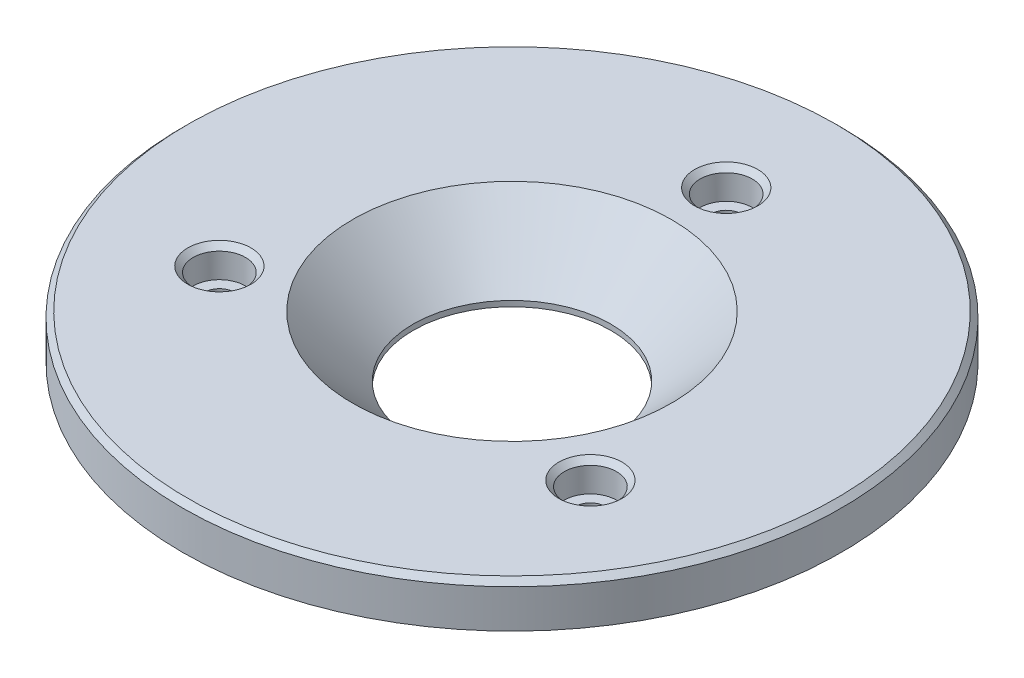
ISO-10303-21;
HEADER;
FILE_DESCRIPTION(('STEP AP214'),'2;1');
FILE_NAME('part.step','',(''),(''),'','','');
FILE_SCHEMA(('AUTOMOTIVE_DESIGN { 1 0 10303 214 1 1 1 1 }'));
ENDSEC;
DATA;
#1=APPLICATION_CONTEXT('core data for automotive mechanical design processes');
#2=APPLICATION_PROTOCOL_DEFINITION('international standard','automotive_design',2000,#1);
#3=PRODUCT_CONTEXT('',#1,'mechanical');
#4=PRODUCT('Part','Part','',(#3));
#5=PRODUCT_RELATED_PRODUCT_CATEGORY('part','',(#4));
#6=PRODUCT_DEFINITION_FORMATION('','',#4);
#7=PRODUCT_DEFINITION_CONTEXT('part definition',#1,'design');
#8=PRODUCT_DEFINITION('design','',#6,#7);
#9=PRODUCT_DEFINITION_SHAPE('','',#8);
#10=(LENGTH_UNIT() NAMED_UNIT(*) SI_UNIT(.MILLI.,.METRE.));
#11=(NAMED_UNIT(*) PLANE_ANGLE_UNIT() SI_UNIT($,.RADIAN.));
#12=(NAMED_UNIT(*) SI_UNIT($,.STERADIAN.) SOLID_ANGLE_UNIT());
#13=UNCERTAINTY_MEASURE_WITH_UNIT(LENGTH_MEASURE(1.E-05),#10,'distance_accuracy_value','');
#14=(GEOMETRIC_REPRESENTATION_CONTEXT(3) GLOBAL_UNCERTAINTY_ASSIGNED_CONTEXT((#13)) GLOBAL_UNIT_ASSIGNED_CONTEXT((#10,
#11,#12)) REPRESENTATION_CONTEXT('',''));
#15=CARTESIAN_POINT('',(0.,0.,0.));
#16=DIRECTION('',(0.,0.,1.));
#17=DIRECTION('',(1.,0.,0.));
#18=AXIS2_PLACEMENT_3D('',#15,#16,#17);
#19=CARTESIAN_POINT('',(-29.,12.,0.));
#20=DIRECTION('',(0.,-1.,0.));
#21=DIRECTION('',(0.,0.,-1.));
#22=AXIS2_PLACEMENT_3D('',#19,#20,#21);
#23=PLANE('',#22);
#24=CARTESIAN_POINT('',(33.7749907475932,12.,19.5));
#25=DIRECTION('',(0.,-1.,0.));
#26=DIRECTION('',(0.,0.,-1.));
#27=AXIS2_PLACEMENT_3D('',#24,#25,#26);
#28=CIRCLE('',#27,5.75);
#29=CARTESIAN_POINT('',(33.7749907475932,12.,13.75));
#30=VERTEX_POINT('',#29);
#31=EDGE_CURVE('E25',#30,#30,#28,.T.);
#32=ORIENTED_EDGE('',*,*,#31,.T.);
#33=EDGE_LOOP('',(#32));
#34=FACE_BOUND('',#33,.T.);
#35=CARTESIAN_POINT('',(0.,12.,-39.));
#36=DIRECTION('',(0.,-1.,0.));
#37=DIRECTION('',(0.,0.,-1.));
#38=AXIS2_PLACEMENT_3D('',#35,#36,#37);
#39=CIRCLE('',#38,5.75);
#40=CARTESIAN_POINT('',(0.,12.,-44.75));
#41=VERTEX_POINT('',#40);
#42=EDGE_CURVE('E29',#41,#41,#39,.T.);
#43=ORIENTED_EDGE('',*,*,#42,.T.);
#44=EDGE_LOOP('',(#43));
#45=FACE_BOUND('',#44,.T.);
#46=CARTESIAN_POINT('',(-33.7749907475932,12.,19.5));
#47=DIRECTION('',(0.,-1.,0.));
#48=DIRECTION('',(0.,0.,-1.));
#49=AXIS2_PLACEMENT_3D('',#46,#47,#48);
#50=CIRCLE('',#49,5.75);
#51=CARTESIAN_POINT('',(-33.7749907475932,12.,13.75));
#52=VERTEX_POINT('',#51);
#53=EDGE_CURVE('E34',#52,#52,#50,.T.);
#54=ORIENTED_EDGE('',*,*,#53,.T.);
#55=EDGE_LOOP('',(#54));
#56=FACE_BOUND('',#55,.T.);
#57=CARTESIAN_POINT('',(0.,12.,0.));
#58=DIRECTION('',(0.,-1.,0.));
#59=DIRECTION('',(0.,0.,-1.));
#60=AXIS2_PLACEMENT_3D('',#57,#58,#59);
#61=CIRCLE('',#60,59.);
#62=CARTESIAN_POINT('',(0.,12.,-59.));
#63=VERTEX_POINT('',#62);
#64=EDGE_CURVE('E58',#63,#63,#61,.F.);
#65=ORIENTED_EDGE('',*,*,#64,.T.);
#66=EDGE_LOOP('',(#65));
#67=FACE_BOUND('',#66,.T.);
#68=CARTESIAN_POINT('',(0.,12.,0.));
#69=DIRECTION('',(0.,-1.,0.));
#70=DIRECTION('',(0.,0.,-1.));
#71=AXIS2_PLACEMENT_3D('',#68,#69,#70);
#72=CIRCLE('',#71,29.);
#73=CARTESIAN_POINT('',(0.,12.,-29.));
#74=VERTEX_POINT('',#73);
#75=EDGE_CURVE('E70',#74,#74,#72,.T.);
#76=ORIENTED_EDGE('',*,*,#75,.T.);
#77=EDGE_LOOP('',(#76));
#78=FACE_BOUND('',#77,.T.);
#79=ADVANCED_FACE('F14',(#34,#45,#56,#67,#78),#23,.F.);
#80=CARTESIAN_POINT('',(0.,1.,0.));
#81=DIRECTION('',(0.,1.,0.));
#82=DIRECTION('',(0.,0.,1.));
#83=AXIS2_PLACEMENT_3D('',#80,#81,#82);
#84=CONICAL_SURFACE('',#83,18.,0.78539816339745);
#85=ORIENTED_EDGE('',*,*,#75,.F.);
#86=EDGE_LOOP('',(#85));
#87=FACE_BOUND('',#86,.T.);
#88=CARTESIAN_POINT('',(0.,1.,0.));
#89=DIRECTION('',(0.,-1.,0.));
#90=DIRECTION('',(0.,0.,-1.));
#91=AXIS2_PLACEMENT_3D('',#88,#89,#90);
#92=CIRCLE('',#91,18.);
#93=CARTESIAN_POINT('',(0.,1.,-18.));
#94=VERTEX_POINT('',#93);
#95=EDGE_CURVE('E83',#94,#94,#92,.T.);
#96=ORIENTED_EDGE('',*,*,#95,.T.);
#97=EDGE_LOOP('',(#96));
#98=FACE_BOUND('',#97,.T.);
#99=ADVANCED_FACE('F123',(#87,#98),#84,.F.);
#100=CARTESIAN_POINT('',(0.,0.,0.));
#101=DIRECTION('',(0.,-1.,0.));
#102=DIRECTION('',(0.,0.,-1.));
#103=AXIS2_PLACEMENT_3D('',#100,#101,#102);
#104=CYLINDRICAL_SURFACE('',#103,18.);
#105=ORIENTED_EDGE('',*,*,#95,.F.);
#106=EDGE_LOOP('',(#105));
#107=FACE_BOUND('',#106,.T.);
#108=CARTESIAN_POINT('',(0.,0.,0.));
#109=DIRECTION('',(0.,-1.,0.));
#110=DIRECTION('',(0.,0.,-1.));
#111=AXIS2_PLACEMENT_3D('',#108,#109,#110);
#112=CIRCLE('',#111,18.);
#113=CARTESIAN_POINT('',(0.,0.,-18.));
#114=VERTEX_POINT('',#113);
#115=EDGE_CURVE('E86',#114,#114,#112,.T.);
#116=ORIENTED_EDGE('',*,*,#115,.T.);
#117=EDGE_LOOP('',(#116));
#118=FACE_BOUND('',#117,.T.);
#119=ADVANCED_FACE('F130',(#107,#118),#104,.F.);
#120=CARTESIAN_POINT('',(-18.,0.,0.));
#121=DIRECTION('',(0.,1.,0.));
#122=DIRECTION('',(0.,0.,1.));
#123=AXIS2_PLACEMENT_3D('',#120,#121,#122);
#124=PLANE('',#123);
#125=CARTESIAN_POINT('',(-33.7749907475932,0.,19.5));
#126=DIRECTION('',(0.,1.,0.));
#127=DIRECTION('',(0.,0.,1.));
#128=AXIS2_PLACEMENT_3D('',#125,#126,#127);
#129=CIRCLE('',#128,3.75);
#130=CARTESIAN_POINT('',(-33.7749907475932,0.,23.25));
#131=VERTEX_POINT('',#130);
#132=EDGE_CURVE('E49',#131,#131,#129,.T.);
#133=ORIENTED_EDGE('',*,*,#132,.T.);
#134=EDGE_LOOP('',(#133));
#135=FACE_BOUND('',#134,.T.);
#136=CARTESIAN_POINT('',(33.7749907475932,0.,19.5));
#137=DIRECTION('',(0.,1.,0.));
#138=DIRECTION('',(0.,0.,1.));
#139=AXIS2_PLACEMENT_3D('',#136,#137,#138);
#140=CIRCLE('',#139,3.75);
#141=CARTESIAN_POINT('',(33.7749907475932,0.,23.25));
#142=VERTEX_POINT('',#141);
#143=EDGE_CURVE('E52',#142,#142,#140,.T.);
#144=ORIENTED_EDGE('',*,*,#143,.T.);
#145=EDGE_LOOP('',(#144));
#146=FACE_BOUND('',#145,.T.);
#147=CARTESIAN_POINT('',(0.,0.,-39.));
#148=DIRECTION('',(0.,1.,0.));
#149=DIRECTION('',(0.,0.,1.));
#150=AXIS2_PLACEMENT_3D('',#147,#148,#149);
#151=CIRCLE('',#150,3.75);
#152=CARTESIAN_POINT('',(0.,0.,-35.25));
#153=VERTEX_POINT('',#152);
#154=EDGE_CURVE('E55',#153,#153,#151,.T.);
#155=ORIENTED_EDGE('',*,*,#154,.T.);
#156=EDGE_LOOP('',(#155));
#157=FACE_BOUND('',#156,.T.);
#158=CARTESIAN_POINT('',(0.,0.,0.));
#159=DIRECTION('',(0.,1.,0.));
#160=DIRECTION('',(0.,0.,1.));
#161=AXIS2_PLACEMENT_3D('',#158,#159,#160);
#162=CIRCLE('',#161,44.);
#163=CARTESIAN_POINT('',(0.,0.,44.));
#164=VERTEX_POINT('',#163);
#165=EDGE_CURVE('E67',#164,#164,#162,.F.);
#166=ORIENTED_EDGE('',*,*,#165,.T.);
#167=EDGE_LOOP('',(#166));
#168=FACE_BOUND('',#167,.T.);
#169=ORIENTED_EDGE('',*,*,#115,.F.);
#170=EDGE_LOOP('',(#169));
#171=FACE_BOUND('',#170,.T.);
#172=ADVANCED_FACE('F181',(#135,#146,#157,#168,#171),#124,.F.);
#173=CARTESIAN_POINT('',(0.,0.,0.));
#174=DIRECTION('',(0.,-1.,0.));
#175=DIRECTION('',(0.,0.,-1.));
#176=AXIS2_PLACEMENT_3D('',#173,#174,#175);
#177=CYLINDRICAL_SURFACE('',#176,45.);
#178=CARTESIAN_POINT('',(0.,0.999999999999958,0.));
#179=DIRECTION('',(0.,1.,0.));
#180=DIRECTION('',(0.,0.,1.));
#181=AXIS2_PLACEMENT_3D('',#178,#179,#180);
#182=CIRCLE('',#181,45.);
#183=CARTESIAN_POINT('',(0.,0.999999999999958,45.));
#184=VERTEX_POINT('',#183);
#185=EDGE_CURVE('E64',#184,#184,#182,.T.);
#186=ORIENTED_EDGE('',*,*,#185,.T.);
#187=EDGE_LOOP('',(#186));
#188=FACE_BOUND('',#187,.T.);
#189=CARTESIAN_POINT('',(0.,4.,0.));
#190=DIRECTION('',(0.,-1.,0.));
#191=DIRECTION('',(0.,0.,-1.));
#192=AXIS2_PLACEMENT_3D('',#189,#190,#191);
#193=CIRCLE('',#192,45.);
#194=CARTESIAN_POINT('',(0.,4.,-45.));
#195=VERTEX_POINT('',#194);
#196=EDGE_CURVE('E89',#195,#195,#193,.T.);
#197=ORIENTED_EDGE('',*,*,#196,.T.);
#198=EDGE_LOOP('',(#197));
#199=FACE_BOUND('',#198,.T.);
#200=ADVANCED_FACE('F185',(#188,#199),#177,.T.);
#201=CARTESIAN_POINT('',(-45.,4.,0.));
#202=DIRECTION('',(0.,1.,0.));
#203=DIRECTION('',(0.,0.,1.));
#204=AXIS2_PLACEMENT_3D('',#201,#202,#203);
#205=PLANE('',#204);
#206=ORIENTED_EDGE('',*,*,#196,.F.);
#207=EDGE_LOOP('',(#206));
#208=FACE_BOUND('',#207,.T.);
#209=CARTESIAN_POINT('',(0.,4.,0.));
#210=DIRECTION('',(0.,-1.,0.));
#211=DIRECTION('',(0.,0.,-1.));
#212=AXIS2_PLACEMENT_3D('',#209,#210,#211);
#213=CIRCLE('',#212,60.);
#214=CARTESIAN_POINT('',(0.,4.,-60.));
#215=VERTEX_POINT('',#214);
#216=EDGE_CURVE('E92',#215,#215,#213,.T.);
#217=ORIENTED_EDGE('',*,*,#216,.T.);
#218=EDGE_LOOP('',(#217));
#219=FACE_BOUND('',#218,.T.);
#220=ADVANCED_FACE('F192',(#208,#219),#205,.F.);
#221=CARTESIAN_POINT('',(0.,0.,0.));
#222=DIRECTION('',(0.,-1.,0.));
#223=DIRECTION('',(0.,0.,-1.));
#224=AXIS2_PLACEMENT_3D('',#221,#222,#223);
#225=CYLINDRICAL_SURFACE('',#224,60.);
#226=CARTESIAN_POINT('',(0.,11.,0.));
#227=DIRECTION('',(0.,-1.,0.));
#228=DIRECTION('',(0.,0.,-1.));
#229=AXIS2_PLACEMENT_3D('',#226,#227,#228);
#230=CIRCLE('',#229,60.);
#231=CARTESIAN_POINT('',(0.,11.,-60.));
#232=VERTEX_POINT('',#231);
#233=EDGE_CURVE('E61',#232,#232,#230,.T.);
#234=ORIENTED_EDGE('',*,*,#233,.T.);
#235=EDGE_LOOP('',(#234));
#236=FACE_BOUND('',#235,.T.);
#237=ORIENTED_EDGE('',*,*,#216,.F.);
#238=EDGE_LOOP('',(#237));
#239=FACE_BOUND('',#238,.T.);
#240=ADVANCED_FACE('F199',(#236,#239),#225,.T.);
#241=CARTESIAN_POINT('',(33.7749907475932,6.5,19.5));
#242=DIRECTION('',(0.,1.,0.));
#243=DIRECTION('',(0.,0.,1.));
#244=AXIS2_PLACEMENT_3D('',#241,#242,#243);
#245=CYLINDRICAL_SURFACE('',#244,4.75);
#246=CARTESIAN_POINT('',(33.7749907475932,11.,19.5));
#247=DIRECTION('',(0.,-1.,0.));
#248=DIRECTION('',(0.,0.,-1.));
#249=AXIS2_PLACEMENT_3D('',#246,#247,#248);
#250=CIRCLE('',#249,4.75);
#251=CARTESIAN_POINT('',(33.7749907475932,11.,14.75));
#252=VERTEX_POINT('',#251);
#253=EDGE_CURVE('E37',#252,#252,#250,.F.);
#254=ORIENTED_EDGE('',*,*,#253,.T.);
#255=EDGE_LOOP('',(#254));
#256=FACE_BOUND('',#255,.T.);
#257=CARTESIAN_POINT('',(33.7749907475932,6.5,19.5));
#258=DIRECTION('',(0.,1.,0.));
#259=DIRECTION('',(0.,0.,-1.));
#260=AXIS2_PLACEMENT_3D('',#257,#258,#259);
#261=CIRCLE('',#260,4.75);
#262=CARTESIAN_POINT('',(33.7749907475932,6.5,14.75));
#263=VERTEX_POINT('',#262);
#264=EDGE_CURVE('E74',#263,#263,#261,.T.);
#265=ORIENTED_EDGE('',*,*,#264,.F.);
#266=EDGE_LOOP('',(#265));
#267=FACE_BOUND('',#266,.T.);
#268=ADVANCED_FACE('F203',(#256,#267),#245,.F.);
#269=CARTESIAN_POINT('',(33.7749907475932,6.5,19.5));
#270=DIRECTION('',(0.,-1.,0.));
#271=DIRECTION('',(0.,0.,-1.));
#272=AXIS2_PLACEMENT_3D('',#269,#270,#271);
#273=PLANE('',#272);
#274=CARTESIAN_POINT('',(33.7749907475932,6.5,19.5));
#275=DIRECTION('',(0.,-1.,0.));
#276=DIRECTION('',(0.,0.,-1.));
#277=AXIS2_PLACEMENT_3D('',#274,#275,#276);
#278=CIRCLE('',#277,2.75);
#279=CARTESIAN_POINT('',(33.7749907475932,6.5,16.75));
#280=VERTEX_POINT('',#279);
#281=EDGE_CURVE('E71',#280,#280,#278,.T.);
#282=ORIENTED_EDGE('',*,*,#281,.T.);
#283=EDGE_LOOP('',(#282));
#284=FACE_BOUND('',#283,.T.);
#285=ORIENTED_EDGE('',*,*,#264,.T.);
#286=EDGE_LOOP('',(#285));
#287=FACE_BOUND('',#286,.T.);
#288=ADVANCED_FACE('F207',(#284,#287),#273,.F.);
#289=CARTESIAN_POINT('',(-33.7749907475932,6.5,19.5));
#290=DIRECTION('',(0.,1.,0.));
#291=DIRECTION('',(0.,0.,1.));
#292=AXIS2_PLACEMENT_3D('',#289,#290,#291);
#293=CYLINDRICAL_SURFACE('',#292,4.75);
#294=CARTESIAN_POINT('',(-33.7749907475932,11.,19.5));
#295=DIRECTION('',(0.,-1.,0.));
#296=DIRECTION('',(0.,0.,-1.));
#297=AXIS2_PLACEMENT_3D('',#294,#295,#296);
#298=CIRCLE('',#297,4.75);
#299=CARTESIAN_POINT('',(-33.7749907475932,11.,14.75));
#300=VERTEX_POINT('',#299);
#301=EDGE_CURVE('E9',#300,#300,#298,.F.);
#302=ORIENTED_EDGE('',*,*,#301,.T.);
#303=EDGE_LOOP('',(#302));
#304=FACE_BOUND('',#303,.T.);
#305=CARTESIAN_POINT('',(-33.7749907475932,6.5,19.5));
#306=DIRECTION('',(0.,1.,0.));
#307=DIRECTION('',(0.,0.,1.));
#308=AXIS2_PLACEMENT_3D('',#305,#306,#307);
#309=CIRCLE('',#308,4.75);
#310=CARTESIAN_POINT('',(-33.7749907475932,6.5,24.25));
#311=VERTEX_POINT('',#310);
#312=EDGE_CURVE('E98',#311,#311,#309,.T.);
#313=ORIENTED_EDGE('',*,*,#312,.F.);
#314=EDGE_LOOP('',(#313));
#315=FACE_BOUND('',#314,.T.);
#316=ADVANCED_FACE('F119',(#304,#315),#293,.F.);
#317=CARTESIAN_POINT('',(-33.7749907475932,6.5,19.5));
#318=DIRECTION('',(0.,1.,0.));
#319=DIRECTION('',(0.,0.,1.));
#320=AXIS2_PLACEMENT_3D('',#317,#318,#319);
#321=PLANE('',#320);
#322=CARTESIAN_POINT('',(-33.7749907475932,6.5,19.5));
#323=DIRECTION('',(0.,1.,0.));
#324=DIRECTION('',(0.,0.,1.));
#325=AXIS2_PLACEMENT_3D('',#322,#323,#324);
#326=CIRCLE('',#325,2.75);
#327=CARTESIAN_POINT('',(-33.7749907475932,6.5,22.25));
#328=VERTEX_POINT('',#327);
#329=EDGE_CURVE('E75',#328,#328,#326,.T.);
#330=ORIENTED_EDGE('',*,*,#329,.F.);
#331=EDGE_LOOP('',(#330));
#332=FACE_BOUND('',#331,.T.);
#333=ORIENTED_EDGE('',*,*,#312,.T.);
#334=EDGE_LOOP('',(#333));
#335=FACE_BOUND('',#334,.T.);
#336=ADVANCED_FACE('F108',(#332,#335),#321,.T.);
#337=CARTESIAN_POINT('',(0.,6.5,-39.));
#338=DIRECTION('',(0.,1.,0.));
#339=DIRECTION('',(0.,0.,1.));
#340=AXIS2_PLACEMENT_3D('',#337,#338,#339);
#341=CYLINDRICAL_SURFACE('',#340,4.75);
#342=CARTESIAN_POINT('',(0.,11.,-39.));
#343=DIRECTION('',(0.,-1.,0.));
#344=DIRECTION('',(0.,0.,-1.));
#345=AXIS2_PLACEMENT_3D('',#342,#343,#344);
#346=CIRCLE('',#345,4.75);
#347=CARTESIAN_POINT('',(0.,11.,-43.75));
#348=VERTEX_POINT('',#347);
#349=EDGE_CURVE('E21',#348,#348,#346,.F.);
#350=ORIENTED_EDGE('',*,*,#349,.T.);
#351=EDGE_LOOP('',(#350));
#352=FACE_BOUND('',#351,.T.);
#353=CARTESIAN_POINT('',(0.,6.5,-39.));
#354=DIRECTION('',(0.,1.,0.));
#355=DIRECTION('',(0.,0.,1.));
#356=AXIS2_PLACEMENT_3D('',#353,#354,#355);
#357=CIRCLE('',#356,4.75);
#358=CARTESIAN_POINT('',(0.,6.5,-34.25));
#359=VERTEX_POINT('',#358);
#360=EDGE_CURVE('E95',#359,#359,#357,.T.);
#361=ORIENTED_EDGE('',*,*,#360,.F.);
#362=EDGE_LOOP('',(#361));
#363=FACE_BOUND('',#362,.T.);
#364=ADVANCED_FACE('F106',(#352,#363),#341,.F.);
#365=CARTESIAN_POINT('',(0.,6.5,-39.));
#366=DIRECTION('',(0.,1.,0.));
#367=DIRECTION('',(0.,0.,1.));
#368=AXIS2_PLACEMENT_3D('',#365,#366,#367);
#369=PLANE('',#368);
#370=CARTESIAN_POINT('',(0.,6.5,-39.));
#371=DIRECTION('',(0.,1.,0.));
#372=DIRECTION('',(0.,0.,1.));
#373=AXIS2_PLACEMENT_3D('',#370,#371,#372);
#374=CIRCLE('',#373,2.75);
#375=CARTESIAN_POINT('',(0.,6.5,-36.25));
#376=VERTEX_POINT('',#375);
#377=EDGE_CURVE('E78',#376,#376,#374,.T.);
#378=ORIENTED_EDGE('',*,*,#377,.F.);
#379=EDGE_LOOP('',(#378));
#380=FACE_BOUND('',#379,.T.);
#381=ORIENTED_EDGE('',*,*,#360,.T.);
#382=EDGE_LOOP('',(#381));
#383=FACE_BOUND('',#382,.T.);
#384=ADVANCED_FACE('F104',(#380,#383),#369,.T.);
#385=CARTESIAN_POINT('',(0.,0.,-39.));
#386=DIRECTION('',(0.,1.,0.));
#387=DIRECTION('',(0.,0.,1.));
#388=AXIS2_PLACEMENT_3D('',#385,#386,#387);
#389=CYLINDRICAL_SURFACE('',#388,2.75);
#390=CARTESIAN_POINT('',(0.,1.,-39.));
#391=DIRECTION('',(0.,1.,0.));
#392=DIRECTION('',(0.,0.,1.));
#393=AXIS2_PLACEMENT_3D('',#390,#391,#392);
#394=CIRCLE('',#393,2.75);
#395=CARTESIAN_POINT('',(0.,1.,-36.25));
#396=VERTEX_POINT('',#395);
#397=EDGE_CURVE('E40',#396,#396,#394,.F.);
#398=ORIENTED_EDGE('',*,*,#397,.T.);
#399=EDGE_LOOP('',(#398));
#400=FACE_BOUND('',#399,.T.);
#401=ORIENTED_EDGE('',*,*,#377,.T.);
#402=EDGE_LOOP('',(#401));
#403=FACE_BOUND('',#402,.T.);
#404=ADVANCED_FACE('F116',(#400,#403),#389,.F.);
#405=CARTESIAN_POINT('',(-33.7749907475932,0.,19.5));
#406=DIRECTION('',(0.,1.,0.));
#407=DIRECTION('',(0.,0.,1.));
#408=AXIS2_PLACEMENT_3D('',#405,#406,#407);
#409=CYLINDRICAL_SURFACE('',#408,2.75);
#410=CARTESIAN_POINT('',(-33.7749907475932,0.999999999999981,19.5));
#411=DIRECTION('',(0.,1.,0.));
#412=DIRECTION('',(0.,0.,1.));
#413=AXIS2_PLACEMENT_3D('',#410,#411,#412);
#414=CIRCLE('',#413,2.75);
#415=CARTESIAN_POINT('',(-33.7749907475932,0.999999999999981,22.25));
#416=VERTEX_POINT('',#415);
#417=EDGE_CURVE('E46',#416,#416,#414,.F.);
#418=ORIENTED_EDGE('',*,*,#417,.T.);
#419=EDGE_LOOP('',(#418));
#420=FACE_BOUND('',#419,.T.);
#421=ORIENTED_EDGE('',*,*,#329,.T.);
#422=EDGE_LOOP('',(#421));
#423=FACE_BOUND('',#422,.T.);
#424=ADVANCED_FACE('F338',(#420,#423),#409,.F.);
#425=CARTESIAN_POINT('',(33.7749907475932,0.,19.5));
#426=DIRECTION('',(0.,1.,0.));
#427=DIRECTION('',(0.,0.,1.));
#428=AXIS2_PLACEMENT_3D('',#425,#426,#427);
#429=CYLINDRICAL_SURFACE('',#428,2.75);
#430=CARTESIAN_POINT('',(33.7749907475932,0.999999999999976,19.5));
#431=DIRECTION('',(0.,1.,0.));
#432=DIRECTION('',(0.,0.,1.));
#433=AXIS2_PLACEMENT_3D('',#430,#431,#432);
#434=CIRCLE('',#433,2.75);
#435=CARTESIAN_POINT('',(33.7749907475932,0.999999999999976,22.25));
#436=VERTEX_POINT('',#435);
#437=EDGE_CURVE('E43',#436,#436,#434,.F.);
#438=ORIENTED_EDGE('',*,*,#437,.T.);
#439=EDGE_LOOP('',(#438));
#440=FACE_BOUND('',#439,.T.);
#441=ORIENTED_EDGE('',*,*,#281,.F.);
#442=EDGE_LOOP('',(#441));
#443=FACE_BOUND('',#442,.T.);
#444=ADVANCED_FACE('F140',(#440,#443),#429,.F.);
#445=CARTESIAN_POINT('',(0.,0.,0.));
#446=DIRECTION('',(0.,1.,0.));
#447=DIRECTION('',(0.,0.,1.));
#448=AXIS2_PLACEMENT_3D('',#445,#446,#447);
#449=CONICAL_SURFACE('',#448,44.,0.785398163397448);
#450=ORIENTED_EDGE('',*,*,#185,.F.);
#451=EDGE_LOOP('',(#450));
#452=FACE_BOUND('',#451,.T.);
#453=ORIENTED_EDGE('',*,*,#165,.F.);
#454=EDGE_LOOP('',(#453));
#455=FACE_BOUND('',#454,.T.);
#456=ADVANCED_FACE('F136',(#452,#455),#449,.T.);
#457=CARTESIAN_POINT('',(0.,11.,0.));
#458=DIRECTION('',(0.,-1.,0.));
#459=DIRECTION('',(0.,0.,-1.));
#460=AXIS2_PLACEMENT_3D('',#457,#458,#459);
#461=CONICAL_SURFACE('',#460,60.,0.785398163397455);
#462=ORIENTED_EDGE('',*,*,#64,.F.);
#463=EDGE_LOOP('',(#462));
#464=FACE_BOUND('',#463,.T.);
#465=ORIENTED_EDGE('',*,*,#233,.F.);
#466=EDGE_LOOP('',(#465));
#467=FACE_BOUND('',#466,.T.);
#468=ADVANCED_FACE('F139',(#464,#467),#461,.T.);
#469=CARTESIAN_POINT('',(-33.7749907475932,0.,19.5));
#470=DIRECTION('',(0.,-1.,0.));
#471=DIRECTION('',(0.,0.,-1.));
#472=AXIS2_PLACEMENT_3D('',#469,#470,#471);
#473=CONICAL_SURFACE('',#472,3.75,0.785398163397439);
#474=ORIENTED_EDGE('',*,*,#417,.F.);
#475=EDGE_LOOP('',(#474));
#476=FACE_BOUND('',#475,.T.);
#477=ORIENTED_EDGE('',*,*,#132,.F.);
#478=EDGE_LOOP('',(#477));
#479=FACE_BOUND('',#478,.T.);
#480=ADVANCED_FACE('F144',(#476,#479),#473,.F.);
#481=CARTESIAN_POINT('',(33.7749907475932,0.,19.5));
#482=DIRECTION('',(0.,-1.,0.));
#483=DIRECTION('',(0.,0.,-1.));
#484=AXIS2_PLACEMENT_3D('',#481,#482,#483);
#485=CONICAL_SURFACE('',#484,3.75,0.785398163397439);
#486=ORIENTED_EDGE('',*,*,#437,.F.);
#487=EDGE_LOOP('',(#486));
#488=FACE_BOUND('',#487,.T.);
#489=ORIENTED_EDGE('',*,*,#143,.F.);
#490=EDGE_LOOP('',(#489));
#491=FACE_BOUND('',#490,.T.);
#492=ADVANCED_FACE('F148',(#488,#491),#485,.F.);
#493=CARTESIAN_POINT('',(0.,0.,-39.));
#494=DIRECTION('',(0.,-1.,0.));
#495=DIRECTION('',(0.,0.,-1.));
#496=AXIS2_PLACEMENT_3D('',#493,#494,#495);
#497=CONICAL_SURFACE('',#496,3.75,0.785398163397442);
#498=ORIENTED_EDGE('',*,*,#397,.F.);
#499=EDGE_LOOP('',(#498));
#500=FACE_BOUND('',#499,.T.);
#501=ORIENTED_EDGE('',*,*,#154,.F.);
#502=EDGE_LOOP('',(#501));
#503=FACE_BOUND('',#502,.T.);
#504=ADVANCED_FACE('F152',(#500,#503),#497,.F.);
#505=CARTESIAN_POINT('',(33.7749907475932,11.,19.5));
#506=DIRECTION('',(0.,1.,0.));
#507=DIRECTION('',(0.,0.,1.));
#508=AXIS2_PLACEMENT_3D('',#505,#506,#507);
#509=CONICAL_SURFACE('',#508,4.75,0.785398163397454);
#510=ORIENTED_EDGE('',*,*,#31,.F.);
#511=EDGE_LOOP('',(#510));
#512=FACE_BOUND('',#511,.T.);
#513=ORIENTED_EDGE('',*,*,#253,.F.);
#514=EDGE_LOOP('',(#513));
#515=FACE_BOUND('',#514,.T.);
#516=ADVANCED_FACE('F156',(#512,#515),#509,.F.);
#517=CARTESIAN_POINT('',(0.,11.,-39.));
#518=DIRECTION('',(0.,1.,0.));
#519=DIRECTION('',(0.,0.,1.));
#520=AXIS2_PLACEMENT_3D('',#517,#518,#519);
#521=CONICAL_SURFACE('',#520,4.75,0.785398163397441);
#522=ORIENTED_EDGE('',*,*,#42,.F.);
#523=EDGE_LOOP('',(#522));
#524=FACE_BOUND('',#523,.T.);
#525=ORIENTED_EDGE('',*,*,#349,.F.);
#526=EDGE_LOOP('',(#525));
#527=FACE_BOUND('',#526,.T.);
#528=ADVANCED_FACE('F159',(#524,#527),#521,.F.);
#529=CARTESIAN_POINT('',(-33.7749907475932,11.,19.5));
#530=DIRECTION('',(0.,1.,0.));
#531=DIRECTION('',(0.,0.,1.));
#532=AXIS2_PLACEMENT_3D('',#529,#530,#531);
#533=CONICAL_SURFACE('',#532,4.75,0.785398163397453);
#534=ORIENTED_EDGE('',*,*,#53,.F.);
#535=EDGE_LOOP('',(#534));
#536=FACE_BOUND('',#535,.T.);
#537=ORIENTED_EDGE('',*,*,#301,.F.);
#538=EDGE_LOOP('',(#537));
#539=FACE_BOUND('',#538,.T.);
#540=ADVANCED_FACE('F16',(#536,#539),#533,.F.);
#541=CLOSED_SHELL('',(#79,#99,#119,#172,#200,#220,#240,#268,#288,#316,#336,#364,#384,#404,#424,
#444,#456,#468,#480,#492,#504,#516,#528,#540));
#542=MANIFOLD_SOLID_BREP('B1',#541);
#543=ADVANCED_BREP_SHAPE_REPRESENTATION('',(#18,#542),#14);
#544=SHAPE_DEFINITION_REPRESENTATION(#9,#543);
ENDSEC;
END-ISO-10303-21;
